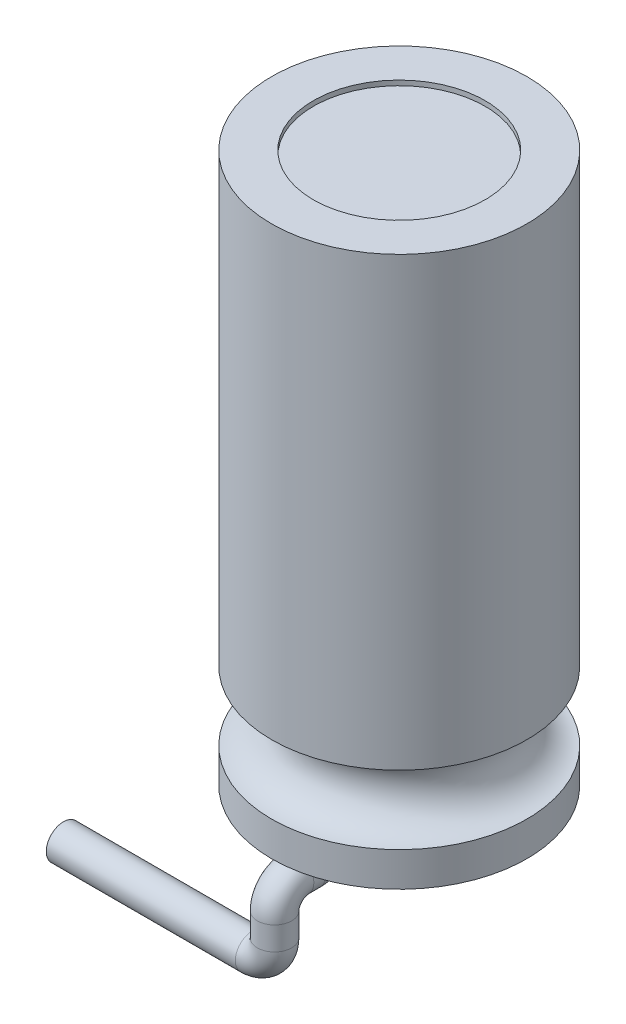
ISO-10303-21;
HEADER;
FILE_DESCRIPTION(('STEP AP214'),'2;1');
FILE_NAME('part.step','',(''),(''),'','','');
FILE_SCHEMA(('AUTOMOTIVE_DESIGN { 1 0 10303 214 1 1 1 1 }'));
ENDSEC;
DATA;
#1=APPLICATION_CONTEXT('core data for automotive mechanical design processes');
#2=APPLICATION_PROTOCOL_DEFINITION('international standard','automotive_design',2000,#1);
#3=PRODUCT_CONTEXT('',#1,'mechanical');
#4=PRODUCT('Part','Part','',(#3));
#5=PRODUCT_RELATED_PRODUCT_CATEGORY('part','',(#4));
#6=PRODUCT_DEFINITION_FORMATION('','',#4);
#7=PRODUCT_DEFINITION_CONTEXT('part definition',#1,'design');
#8=PRODUCT_DEFINITION('design','',#6,#7);
#9=PRODUCT_DEFINITION_SHAPE('','',#8);
#10=(LENGTH_UNIT() NAMED_UNIT(*) SI_UNIT(.MILLI.,.METRE.));
#11=(NAMED_UNIT(*) PLANE_ANGLE_UNIT() SI_UNIT($,.RADIAN.));
#12=(NAMED_UNIT(*) SI_UNIT($,.STERADIAN.) SOLID_ANGLE_UNIT());
#13=UNCERTAINTY_MEASURE_WITH_UNIT(LENGTH_MEASURE(1.E-05),#10,'distance_accuracy_value','');
#14=(GEOMETRIC_REPRESENTATION_CONTEXT(3) GLOBAL_UNCERTAINTY_ASSIGNED_CONTEXT((#13)) GLOBAL_UNIT_ASSIGNED_CONTEXT((#10,
#11,#12)) REPRESENTATION_CONTEXT('',''));
#15=CARTESIAN_POINT('',(0.,0.,0.));
#16=DIRECTION('',(0.,0.,1.));
#17=DIRECTION('',(1.,0.,0.));
#18=AXIS2_PLACEMENT_3D('',#15,#16,#17);
#19=CARTESIAN_POINT('',(2.6,27.5164236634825,0.));
#20=DIRECTION('',(0.,1.,0.));
#21=DIRECTION('',(0.,0.,1.));
#22=AXIS2_PLACEMENT_3D('',#19,#20,#21);
#23=PLANE('',#22);
#24=CARTESIAN_POINT('',(0.,27.5164236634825,-1.4));
#25=DIRECTION('',(0.,1.,0.));
#26=DIRECTION('',(0.,0.,1.));
#27=AXIS2_PLACEMENT_3D('',#24,#25,#26);
#28=CIRCLE('',#27,0.35);
#29=CARTESIAN_POINT('',(0.,27.5164236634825,-1.05));
#30=VERTEX_POINT('',#29);
#31=EDGE_CURVE('E90',#30,#30,#28,.T.);
#32=ORIENTED_EDGE('',*,*,#31,.T.);
#33=EDGE_LOOP('',(#32));
#34=FACE_BOUND('',#33,.T.);
#35=CARTESIAN_POINT('',(0.,27.5164236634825,0.));
#36=DIRECTION('',(0.,1.,0.));
#37=DIRECTION('',(0.,0.,1.));
#38=AXIS2_PLACEMENT_3D('',#35,#36,#37);
#39=CIRCLE('',#38,2.6);
#40=CARTESIAN_POINT('',(0.,27.5164236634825,2.6));
#41=VERTEX_POINT('',#40);
#42=EDGE_CURVE('E40',#41,#41,#39,.T.);
#43=ORIENTED_EDGE('',*,*,#42,.F.);
#44=EDGE_LOOP('',(#43));
#45=FACE_BOUND('',#44,.T.);
#46=CARTESIAN_POINT('',(0.,27.5164236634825,1.4));
#47=DIRECTION('',(0.,-1.,0.));
#48=DIRECTION('',(0.,0.,-1.));
#49=AXIS2_PLACEMENT_3D('',#46,#47,#48);
#50=CIRCLE('',#49,0.35);
#51=CARTESIAN_POINT('',(0.,27.5164236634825,1.05));
#52=VERTEX_POINT('',#51);
#53=EDGE_CURVE('E10',#52,#52,#50,.T.);
#54=ORIENTED_EDGE('',*,*,#53,.F.);
#55=EDGE_LOOP('',(#54));
#56=FACE_BOUND('',#55,.T.);
#57=ADVANCED_FACE('F37',(#34,#45,#56),#23,.F.);
#58=CARTESIAN_POINT('',(0.,48.4017094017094,0.));
#59=DIRECTION('',(0.,1.,0.));
#60=DIRECTION('',(0.,0.,1.));
#61=AXIS2_PLACEMENT_3D('',#58,#59,#60);
#62=CYLINDRICAL_SURFACE('',#61,2.6);
#63=CARTESIAN_POINT('',(0.,28.2164236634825,0.));
#64=DIRECTION('',(0.,1.,0.));
#65=DIRECTION('',(0.,0.,1.));
#66=AXIS2_PLACEMENT_3D('',#63,#64,#65);
#67=CIRCLE('',#66,2.6);
#68=CARTESIAN_POINT('',(0.,28.2164236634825,2.6));
#69=VERTEX_POINT('',#68);
#70=EDGE_CURVE('E48',#69,#69,#67,.T.);
#71=ORIENTED_EDGE('',*,*,#70,.F.);
#72=EDGE_LOOP('',(#71));
#73=FACE_BOUND('',#72,.T.);
#74=ORIENTED_EDGE('',*,*,#42,.T.);
#75=EDGE_LOOP('',(#74));
#76=FACE_BOUND('',#75,.T.);
#77=ADVANCED_FACE('F78',(#73,#76),#62,.T.);
#78=CARTESIAN_POINT('',(0.,28.9164236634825,0.));
#79=DIRECTION('',(0.,1.,0.));
#80=DIRECTION('',(0.,0.,1.));
#81=AXIS2_PLACEMENT_3D('',#78,#79,#80);
#82=TOROIDAL_SURFACE('',#81,2.6,0.699999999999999);
#83=CARTESIAN_POINT('',(0.,29.6164236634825,0.));
#84=DIRECTION('',(0.,1.,0.));
#85=DIRECTION('',(0.,0.,1.));
#86=AXIS2_PLACEMENT_3D('',#83,#84,#85);
#87=CIRCLE('',#86,2.6);
#88=CARTESIAN_POINT('',(0.,29.6164236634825,2.6));
#89=VERTEX_POINT('',#88);
#90=EDGE_CURVE('E71',#89,#89,#87,.T.);
#91=ORIENTED_EDGE('',*,*,#90,.F.);
#92=EDGE_LOOP('',(#91));
#93=FACE_BOUND('',#92,.T.);
#94=ORIENTED_EDGE('',*,*,#70,.T.);
#95=EDGE_LOOP('',(#94));
#96=FACE_BOUND('',#95,.T.);
#97=ADVANCED_FACE('F76',(#93,#96),#82,.F.);
#98=CARTESIAN_POINT('',(0.,48.4017094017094,0.));
#99=DIRECTION('',(0.,1.,0.));
#100=DIRECTION('',(0.,0.,1.));
#101=AXIS2_PLACEMENT_3D('',#98,#99,#100);
#102=CYLINDRICAL_SURFACE('',#101,2.6);
#103=CARTESIAN_POINT('',(0.,38.7164236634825,0.));
#104=DIRECTION('',(0.,1.,0.));
#105=DIRECTION('',(0.,0.,1.));
#106=AXIS2_PLACEMENT_3D('',#103,#104,#105);
#107=CIRCLE('',#106,2.6);
#108=CARTESIAN_POINT('',(0.,38.7164236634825,2.6));
#109=VERTEX_POINT('',#108);
#110=EDGE_CURVE('E66',#109,#109,#107,.T.);
#111=ORIENTED_EDGE('',*,*,#110,.F.);
#112=EDGE_LOOP('',(#111));
#113=FACE_BOUND('',#112,.T.);
#114=ORIENTED_EDGE('',*,*,#90,.T.);
#115=EDGE_LOOP('',(#114));
#116=FACE_BOUND('',#115,.T.);
#117=ADVANCED_FACE('F162',(#113,#116),#102,.T.);
#118=CARTESIAN_POINT('',(0.,38.7164236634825,0.));
#119=DIRECTION('',(0.,-1.,0.));
#120=DIRECTION('',(0.,0.,-1.));
#121=AXIS2_PLACEMENT_3D('',#118,#119,#120);
#122=PLANE('',#121);
#123=CARTESIAN_POINT('',(0.,38.7164236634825,0.));
#124=DIRECTION('',(0.,1.,0.));
#125=DIRECTION('',(0.,0.,1.));
#126=AXIS2_PLACEMENT_3D('',#123,#124,#125);
#127=CIRCLE('',#126,1.75);
#128=CARTESIAN_POINT('',(0.,38.7164236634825,1.75));
#129=VERTEX_POINT('',#128);
#130=EDGE_CURVE('E62',#129,#129,#127,.T.);
#131=ORIENTED_EDGE('',*,*,#130,.F.);
#132=EDGE_LOOP('',(#131));
#133=FACE_BOUND('',#132,.T.);
#134=ORIENTED_EDGE('',*,*,#110,.T.);
#135=EDGE_LOOP('',(#134));
#136=FACE_BOUND('',#135,.T.);
#137=ADVANCED_FACE('F158',(#133,#136),#122,.F.);
#138=CARTESIAN_POINT('',(0.,38.6164236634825,0.));
#139=DIRECTION('',(0.,1.,0.));
#140=DIRECTION('',(0.,0.,1.));
#141=AXIS2_PLACEMENT_3D('',#138,#139,#140);
#142=CYLINDRICAL_SURFACE('',#141,1.75);
#143=CARTESIAN_POINT('',(0.,38.6164236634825,0.));
#144=DIRECTION('',(0.,1.,0.));
#145=DIRECTION('',(0.,0.,1.));
#146=AXIS2_PLACEMENT_3D('',#143,#144,#145);
#147=CIRCLE('',#146,1.75);
#148=CARTESIAN_POINT('',(0.,38.6164236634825,1.75));
#149=VERTEX_POINT('',#148);
#150=EDGE_CURVE('E63',#149,#149,#147,.T.);
#151=ORIENTED_EDGE('',*,*,#150,.F.);
#152=EDGE_LOOP('',(#151));
#153=FACE_BOUND('',#152,.T.);
#154=ORIENTED_EDGE('',*,*,#130,.T.);
#155=EDGE_LOOP('',(#154));
#156=FACE_BOUND('',#155,.T.);
#157=ADVANCED_FACE('F154',(#153,#156),#142,.F.);
#158=CARTESIAN_POINT('',(0.,38.6164236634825,0.));
#159=DIRECTION('',(0.,1.,0.));
#160=DIRECTION('',(0.,0.,1.));
#161=AXIS2_PLACEMENT_3D('',#158,#159,#160);
#162=PLANE('',#161);
#163=ORIENTED_EDGE('',*,*,#150,.T.);
#164=EDGE_LOOP('',(#163));
#165=FACE_BOUND('',#164,.T.);
#166=ADVANCED_FACE('F150',(#165),#162,.T.);
#167=CARTESIAN_POINT('',(0.,26.5664236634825,2.54));
#168=DIRECTION('',(0.,-1.,0.));
#169=DIRECTION('',(0.,0.,-1.));
#170=AXIS2_PLACEMENT_3D('',#167,#168,#169);
#171=CYLINDRICAL_SURFACE('',#170,0.35);
#172=CARTESIAN_POINT('',(0.,26.5664236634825,2.54));
#173=DIRECTION('',(0.,-1.,0.));
#174=DIRECTION('',(0.,0.,-1.));
#175=AXIS2_PLACEMENT_3D('',#172,#173,#174);
#176=CIRCLE('',#175,0.35);
#177=CARTESIAN_POINT('',(0.,26.5664236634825,2.89));
#178=VERTEX_POINT('',#177);
#179=EDGE_CURVE('E59',#178,#178,#176,.T.);
#180=ORIENTED_EDGE('',*,*,#179,.T.);
#181=EDGE_LOOP('',(#180));
#182=FACE_BOUND('',#181,.T.);
#183=CARTESIAN_POINT('',(0.,26.0898294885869,2.54));
#184=DIRECTION('',(0.,-1.,0.));
#185=DIRECTION('',(0.,0.,-1.));
#186=AXIS2_PLACEMENT_3D('',#183,#184,#185);
#187=CIRCLE('',#186,0.350000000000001);
#188=CARTESIAN_POINT('',(0.350000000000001,26.0898294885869,2.54));
#189=VERTEX_POINT('',#188);
#190=EDGE_CURVE('E110',#189,#189,#187,.T.);
#191=ORIENTED_EDGE('',*,*,#190,.F.);
#192=EDGE_LOOP('',(#191));
#193=FACE_BOUND('',#192,.T.);
#194=ADVANCED_FACE('F146',(#182,#193),#171,.T.);
#195=CARTESIAN_POINT('',(0.,26.5664236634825,2.09));
#196=DIRECTION('',(1.,0.,0.));
#197=DIRECTION('',(0.,0.,-1.));
#198=AXIS2_PLACEMENT_3D('',#195,#196,#197);
#199=TOROIDAL_SURFACE('',#198,0.449999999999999,0.35);
#200=CARTESIAN_POINT('',(0.,27.0164236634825,2.08999999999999));
#201=DIRECTION('',(0.,0.,1.));
#202=DIRECTION('',(0.,-1.,0.));
#203=AXIS2_PLACEMENT_3D('',#200,#201,#202);
#204=CIRCLE('',#203,0.35);
#205=CARTESIAN_POINT('',(0.,27.3664236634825,2.08999999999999));
#206=VERTEX_POINT('',#205);
#207=EDGE_CURVE('E56',#206,#206,#204,.T.);
#208=CARTESIAN_POINT('',(0.,26.5664236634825,2.09));
#209=DIRECTION('',(1.,0.,0.));
#210=DIRECTION('',(0.,0.,-1.));
#211=AXIS2_PLACEMENT_3D('',#208,#209,#210);
#212=CIRCLE('',#211,0.799999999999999);
#213=EDGE_CURVE('',#206,#178,#212,.T.);
#214=ORIENTED_EDGE('',*,*,#207,.T.);
#215=ORIENTED_EDGE('',*,*,#179,.F.);
#216=ORIENTED_EDGE('',*,*,#213,.T.);
#217=ORIENTED_EDGE('',*,*,#213,.F.);
#218=EDGE_LOOP('',(#214,#216,#215,#217));
#219=FACE_BOUND('',#218,.T.);
#220=ADVANCED_FACE('F142',(#219),#199,.T.);
#221=CARTESIAN_POINT('',(0.,27.0164236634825,1.85));
#222=DIRECTION('',(0.,0.,1.));
#223=DIRECTION('',(1.,0.,0.));
#224=AXIS2_PLACEMENT_3D('',#221,#222,#223);
#225=CYLINDRICAL_SURFACE('',#224,0.35);
#226=CARTESIAN_POINT('',(0.,27.0164236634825,1.85));
#227=DIRECTION('',(0.,0.,1.));
#228=DIRECTION('',(0.,-1.,0.));
#229=AXIS2_PLACEMENT_3D('',#226,#227,#228);
#230=CIRCLE('',#229,0.35);
#231=CARTESIAN_POINT('',(0.,26.6664236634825,1.85));
#232=VERTEX_POINT('',#231);
#233=EDGE_CURVE('E53',#232,#232,#230,.T.);
#234=ORIENTED_EDGE('',*,*,#233,.T.);
#235=EDGE_LOOP('',(#234));
#236=FACE_BOUND('',#235,.T.);
#237=ORIENTED_EDGE('',*,*,#207,.F.);
#238=EDGE_LOOP('',(#237));
#239=FACE_BOUND('',#238,.T.);
#240=ADVANCED_FACE('F136',(#236,#239),#225,.T.);
#241=CARTESIAN_POINT('',(0.,27.4664236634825,1.85));
#242=DIRECTION('',(-1.,0.,0.));
#243=DIRECTION('',(0.,0.,1.));
#244=AXIS2_PLACEMENT_3D('',#241,#242,#243);
#245=TOROIDAL_SURFACE('',#244,0.449999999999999,0.35);
#246=CARTESIAN_POINT('',(0.,27.4664236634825,1.4));
#247=DIRECTION('',(0.,-1.,0.));
#248=DIRECTION('',(0.,0.,-1.));
#249=AXIS2_PLACEMENT_3D('',#246,#247,#248);
#250=CIRCLE('',#249,0.35);
#251=CARTESIAN_POINT('',(0.,27.4664236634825,1.05));
#252=VERTEX_POINT('',#251);
#253=EDGE_CURVE('E51',#252,#252,#250,.T.);
#254=CARTESIAN_POINT('',(0.,27.4664236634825,1.85));
#255=DIRECTION('',(-1.,0.,0.));
#256=DIRECTION('',(0.,0.,1.));
#257=AXIS2_PLACEMENT_3D('',#254,#255,#256);
#258=CIRCLE('',#257,0.799999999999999);
#259=EDGE_CURVE('',#252,#232,#258,.T.);
#260=ORIENTED_EDGE('',*,*,#253,.T.);
#261=ORIENTED_EDGE('',*,*,#233,.F.);
#262=ORIENTED_EDGE('',*,*,#259,.T.);
#263=ORIENTED_EDGE('',*,*,#259,.F.);
#264=EDGE_LOOP('',(#260,#262,#261,#263));
#265=FACE_BOUND('',#264,.T.);
#266=ADVANCED_FACE('F122',(#265),#245,.T.);
#267=CARTESIAN_POINT('',(0.,27.4664236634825,1.4));
#268=DIRECTION('',(0.,1.,0.));
#269=DIRECTION('',(0.,0.,1.));
#270=AXIS2_PLACEMENT_3D('',#267,#268,#269);
#271=CYLINDRICAL_SURFACE('',#270,0.35);
#272=ORIENTED_EDGE('',*,*,#253,.F.);
#273=EDGE_LOOP('',(#272));
#274=FACE_BOUND('',#273,.T.);
#275=ORIENTED_EDGE('',*,*,#53,.T.);
#276=EDGE_LOOP('',(#275));
#277=FACE_BOUND('',#276,.T.);
#278=ADVANCED_FACE('F125',(#274,#277),#271,.T.);
#279=CARTESIAN_POINT('',(-0.450000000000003,25.6398294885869,2.54));
#280=DIRECTION('',(-1.,0.,0.));
#281=DIRECTION('',(0.,0.,1.));
#282=AXIS2_PLACEMENT_3D('',#279,#280,#281);
#283=CYLINDRICAL_SURFACE('',#282,0.350000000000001);
#284=CARTESIAN_POINT('',(-0.450000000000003,25.6398294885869,2.54));
#285=DIRECTION('',(-1.,0.,0.));
#286=DIRECTION('',(0.,0.,-1.));
#287=AXIS2_PLACEMENT_3D('',#284,#285,#286);
#288=CIRCLE('',#287,0.350000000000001);
#289=CARTESIAN_POINT('',(-0.450000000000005,25.2898294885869,2.54));
#290=VERTEX_POINT('',#289);
#291=EDGE_CURVE('E113',#290,#290,#288,.T.);
#292=ORIENTED_EDGE('',*,*,#291,.T.);
#293=EDGE_LOOP('',(#292));
#294=FACE_BOUND('',#293,.T.);
#295=CARTESIAN_POINT('',(-4.3,25.6398294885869,2.54));
#296=DIRECTION('',(-1.,0.,0.));
#297=DIRECTION('',(0.,0.,-1.));
#298=AXIS2_PLACEMENT_3D('',#295,#296,#297);
#299=CIRCLE('',#298,0.350000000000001);
#300=CARTESIAN_POINT('',(-4.3,25.6398294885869,2.19));
#301=VERTEX_POINT('',#300);
#302=EDGE_CURVE('E115',#301,#301,#299,.T.);
#303=ORIENTED_EDGE('',*,*,#302,.F.);
#304=EDGE_LOOP('',(#303));
#305=FACE_BOUND('',#304,.T.);
#306=ADVANCED_FACE('F127',(#294,#305),#283,.T.);
#307=CARTESIAN_POINT('',(-0.45,26.0898294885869,2.54));
#308=DIRECTION('',(0.,0.,-1.));
#309=DIRECTION('',(-1.,0.,0.));
#310=AXIS2_PLACEMENT_3D('',#307,#308,#309);
#311=TOROIDAL_SURFACE('',#310,0.449999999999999,0.350000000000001);
#312=CARTESIAN_POINT('',(-0.45,26.0898294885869,2.54));
#313=DIRECTION('',(0.,0.,-1.));
#314=DIRECTION('',(-1.,0.,0.));
#315=AXIS2_PLACEMENT_3D('',#312,#313,#314);
#316=CIRCLE('',#315,0.800000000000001);
#317=EDGE_CURVE('',#189,#290,#316,.T.);
#318=ORIENTED_EDGE('',*,*,#190,.T.);
#319=ORIENTED_EDGE('',*,*,#291,.F.);
#320=ORIENTED_EDGE('',*,*,#317,.T.);
#321=ORIENTED_EDGE('',*,*,#317,.F.);
#322=EDGE_LOOP('',(#318,#320,#319,#321));
#323=FACE_BOUND('',#322,.T.);
#324=ADVANCED_FACE('F133',(#323),#311,.T.);
#325=CARTESIAN_POINT('',(-4.3,25.6398294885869,2.54));
#326=DIRECTION('',(-1.,0.,0.));
#327=DIRECTION('',(0.,0.,-1.));
#328=AXIS2_PLACEMENT_3D('',#325,#326,#327);
#329=PLANE('',#328);
#330=ORIENTED_EDGE('',*,*,#302,.T.);
#331=EDGE_LOOP('',(#330));
#332=FACE_BOUND('',#331,.T.);
#333=ADVANCED_FACE('F232',(#332),#329,.T.);
#334=CARTESIAN_POINT('',(0.,26.5664236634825,-2.54));
#335=DIRECTION('',(0.,-1.,0.));
#336=DIRECTION('',(0.,0.,-1.));
#337=AXIS2_PLACEMENT_3D('',#334,#335,#336);
#338=CYLINDRICAL_SURFACE('',#337,0.35);
#339=CARTESIAN_POINT('',(0.,26.5664236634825,-2.54));
#340=DIRECTION('',(0.,1.,0.));
#341=DIRECTION('',(0.,0.,1.));
#342=AXIS2_PLACEMENT_3D('',#339,#340,#341);
#343=CIRCLE('',#342,0.35);
#344=CARTESIAN_POINT('',(0.,26.5664236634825,-2.89));
#345=VERTEX_POINT('',#344);
#346=EDGE_CURVE('E107',#345,#345,#343,.T.);
#347=ORIENTED_EDGE('',*,*,#346,.F.);
#348=EDGE_LOOP('',(#347));
#349=FACE_BOUND('',#348,.T.);
#350=CARTESIAN_POINT('',(0.,26.0898294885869,-2.54));
#351=DIRECTION('',(0.,1.,0.));
#352=DIRECTION('',(0.,0.,1.));
#353=AXIS2_PLACEMENT_3D('',#350,#351,#352);
#354=CIRCLE('',#353,0.350000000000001);
#355=CARTESIAN_POINT('',(0.350000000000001,26.0898294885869,-2.54));
#356=VERTEX_POINT('',#355);
#357=EDGE_CURVE('E324',#356,#356,#354,.T.);
#358=ORIENTED_EDGE('',*,*,#357,.T.);
#359=EDGE_LOOP('',(#358));
#360=FACE_BOUND('',#359,.T.);
#361=ADVANCED_FACE('F240',(#349,#360),#338,.T.);
#362=CARTESIAN_POINT('',(0.,26.5664236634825,-2.09));
#363=DIRECTION('',(-1.,0.,0.));
#364=DIRECTION('',(0.,0.,1.));
#365=AXIS2_PLACEMENT_3D('',#362,#363,#364);
#366=TOROIDAL_SURFACE('',#365,0.449999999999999,0.35);
#367=CARTESIAN_POINT('',(0.,27.0164236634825,-2.08999999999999));
#368=DIRECTION('',(0.,0.,1.));
#369=DIRECTION('',(0.,-1.,0.));
#370=AXIS2_PLACEMENT_3D('',#367,#368,#369);
#371=CIRCLE('',#370,0.35);
#372=CARTESIAN_POINT('',(0.,27.3664236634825,-2.08999999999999));
#373=VERTEX_POINT('',#372);
#374=EDGE_CURVE('E104',#373,#373,#371,.T.);
#375=CARTESIAN_POINT('',(0.,26.5664236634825,-2.09));
#376=DIRECTION('',(-1.,0.,0.));
#377=DIRECTION('',(0.,0.,1.));
#378=AXIS2_PLACEMENT_3D('',#375,#376,#377);
#379=CIRCLE('',#378,0.799999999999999);
#380=EDGE_CURVE('',#373,#345,#379,.T.);
#381=ORIENTED_EDGE('',*,*,#374,.F.);
#382=ORIENTED_EDGE('',*,*,#346,.T.);
#383=ORIENTED_EDGE('',*,*,#380,.T.);
#384=ORIENTED_EDGE('',*,*,#380,.F.);
#385=EDGE_LOOP('',(#381,#383,#382,#384));
#386=FACE_BOUND('',#385,.T.);
#387=ADVANCED_FACE('F248',(#386),#366,.T.);
#388=CARTESIAN_POINT('',(0.,27.0164236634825,-1.85));
#389=DIRECTION('',(0.,0.,-1.));
#390=DIRECTION('',(-1.,0.,0.));
#391=AXIS2_PLACEMENT_3D('',#388,#389,#390);
#392=CYLINDRICAL_SURFACE('',#391,0.35);
#393=CARTESIAN_POINT('',(0.,27.0164236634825,-1.85));
#394=DIRECTION('',(0.,0.,1.));
#395=DIRECTION('',(0.,-1.,0.));
#396=AXIS2_PLACEMENT_3D('',#393,#394,#395);
#397=CIRCLE('',#396,0.35);
#398=CARTESIAN_POINT('',(0.,26.6664236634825,-1.85));
#399=VERTEX_POINT('',#398);
#400=EDGE_CURVE('E96',#399,#399,#397,.T.);
#401=ORIENTED_EDGE('',*,*,#400,.F.);
#402=EDGE_LOOP('',(#401));
#403=FACE_BOUND('',#402,.T.);
#404=ORIENTED_EDGE('',*,*,#374,.T.);
#405=EDGE_LOOP('',(#404));
#406=FACE_BOUND('',#405,.T.);
#407=ADVANCED_FACE('F261',(#403,#406),#392,.T.);
#408=CARTESIAN_POINT('',(0.,27.4664236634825,-1.85));
#409=DIRECTION('',(1.,0.,0.));
#410=DIRECTION('',(0.,0.,-1.));
#411=AXIS2_PLACEMENT_3D('',#408,#409,#410);
#412=TOROIDAL_SURFACE('',#411,0.449999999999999,0.35);
#413=CARTESIAN_POINT('',(0.,27.4664236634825,-1.4));
#414=DIRECTION('',(0.,1.,0.));
#415=DIRECTION('',(0.,0.,1.));
#416=AXIS2_PLACEMENT_3D('',#413,#414,#415);
#417=CIRCLE('',#416,0.35);
#418=CARTESIAN_POINT('',(0.,27.4664236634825,-1.05));
#419=VERTEX_POINT('',#418);
#420=EDGE_CURVE('E92',#419,#419,#417,.T.);
#421=CARTESIAN_POINT('',(0.,27.4664236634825,-1.85));
#422=DIRECTION('',(1.,0.,0.));
#423=DIRECTION('',(0.,0.,-1.));
#424=AXIS2_PLACEMENT_3D('',#421,#422,#423);
#425=CIRCLE('',#424,0.799999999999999);
#426=EDGE_CURVE('',#419,#399,#425,.T.);
#427=ORIENTED_EDGE('',*,*,#420,.F.);
#428=ORIENTED_EDGE('',*,*,#400,.T.);
#429=ORIENTED_EDGE('',*,*,#426,.T.);
#430=ORIENTED_EDGE('',*,*,#426,.F.);
#431=EDGE_LOOP('',(#427,#429,#428,#430));
#432=FACE_BOUND('',#431,.T.);
#433=ADVANCED_FACE('F270',(#432),#412,.T.);
#434=CARTESIAN_POINT('',(0.,27.4664236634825,-1.4));
#435=DIRECTION('',(0.,1.,0.));
#436=DIRECTION('',(0.,0.,1.));
#437=AXIS2_PLACEMENT_3D('',#434,#435,#436);
#438=CYLINDRICAL_SURFACE('',#437,0.35);
#439=ORIENTED_EDGE('',*,*,#420,.T.);
#440=EDGE_LOOP('',(#439));
#441=FACE_BOUND('',#440,.T.);
#442=ORIENTED_EDGE('',*,*,#31,.F.);
#443=EDGE_LOOP('',(#442));
#444=FACE_BOUND('',#443,.T.);
#445=ADVANCED_FACE('F278',(#441,#444),#438,.T.);
#446=CARTESIAN_POINT('',(-0.450000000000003,25.6398294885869,-2.54));
#447=DIRECTION('',(-1.,0.,0.));
#448=DIRECTION('',(0.,0.,1.));
#449=AXIS2_PLACEMENT_3D('',#446,#447,#448);
#450=CYLINDRICAL_SURFACE('',#449,0.350000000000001);
#451=CARTESIAN_POINT('',(-0.450000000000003,25.6398294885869,-2.54));
#452=DIRECTION('',(1.,0.,0.));
#453=DIRECTION('',(0.,0.,1.));
#454=AXIS2_PLACEMENT_3D('',#451,#452,#453);
#455=CIRCLE('',#454,0.350000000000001);
#456=CARTESIAN_POINT('',(-0.450000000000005,25.2898294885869,-2.54));
#457=VERTEX_POINT('',#456);
#458=EDGE_CURVE('E99',#457,#457,#455,.T.);
#459=ORIENTED_EDGE('',*,*,#458,.F.);
#460=EDGE_LOOP('',(#459));
#461=FACE_BOUND('',#460,.T.);
#462=CARTESIAN_POINT('',(-4.3,25.6398294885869,-2.54));
#463=DIRECTION('',(1.,0.,0.));
#464=DIRECTION('',(0.,0.,1.));
#465=AXIS2_PLACEMENT_3D('',#462,#463,#464);
#466=CIRCLE('',#465,0.350000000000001);
#467=CARTESIAN_POINT('',(-4.3,25.6398294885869,-2.19));
#468=VERTEX_POINT('',#467);
#469=EDGE_CURVE('E93',#468,#468,#466,.T.);
#470=ORIENTED_EDGE('',*,*,#469,.T.);
#471=EDGE_LOOP('',(#470));
#472=FACE_BOUND('',#471,.T.);
#473=ADVANCED_FACE('F286',(#461,#472),#450,.T.);
#474=CARTESIAN_POINT('',(-0.45,26.0898294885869,-2.54));
#475=DIRECTION('',(0.,0.,-1.));
#476=DIRECTION('',(-1.,0.,0.));
#477=AXIS2_PLACEMENT_3D('',#474,#475,#476);
#478=TOROIDAL_SURFACE('',#477,0.449999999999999,0.350000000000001);
#479=CARTESIAN_POINT('',(-0.45,26.0898294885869,-2.54));
#480=DIRECTION('',(0.,0.,-1.));
#481=DIRECTION('',(-1.,0.,0.));
#482=AXIS2_PLACEMENT_3D('',#479,#480,#481);
#483=CIRCLE('',#482,0.800000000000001);
#484=EDGE_CURVE('',#356,#457,#483,.T.);
#485=ORIENTED_EDGE('',*,*,#357,.F.);
#486=ORIENTED_EDGE('',*,*,#458,.T.);
#487=ORIENTED_EDGE('',*,*,#484,.T.);
#488=ORIENTED_EDGE('',*,*,#484,.F.);
#489=EDGE_LOOP('',(#485,#487,#486,#488));
#490=FACE_BOUND('',#489,.T.);
#491=ADVANCED_FACE('F295',(#490),#478,.T.);
#492=CARTESIAN_POINT('',(-4.3,25.6398294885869,-2.54));
#493=DIRECTION('',(-1.,0.,0.));
#494=DIRECTION('',(0.,0.,1.));
#495=AXIS2_PLACEMENT_3D('',#492,#493,#494);
#496=PLANE('',#495);
#497=ORIENTED_EDGE('',*,*,#469,.F.);
#498=EDGE_LOOP('',(#497));
#499=FACE_BOUND('',#498,.T.);
#500=ADVANCED_FACE('F305',(#499),#496,.T.);
#501=CLOSED_SHELL('',(#57,#77,#97,#117,#137,#157,#166,#194,#220,#240,#266,#278,#306,#324,#333,
#361,#387,#407,#433,#445,#473,#491,#500));
#502=MANIFOLD_SOLID_BREP('B2',#501);
#503=ADVANCED_BREP_SHAPE_REPRESENTATION('',(#18,#502),#14);
#504=SHAPE_DEFINITION_REPRESENTATION(#9,#503);
ENDSEC;
END-ISO-10303-21;
